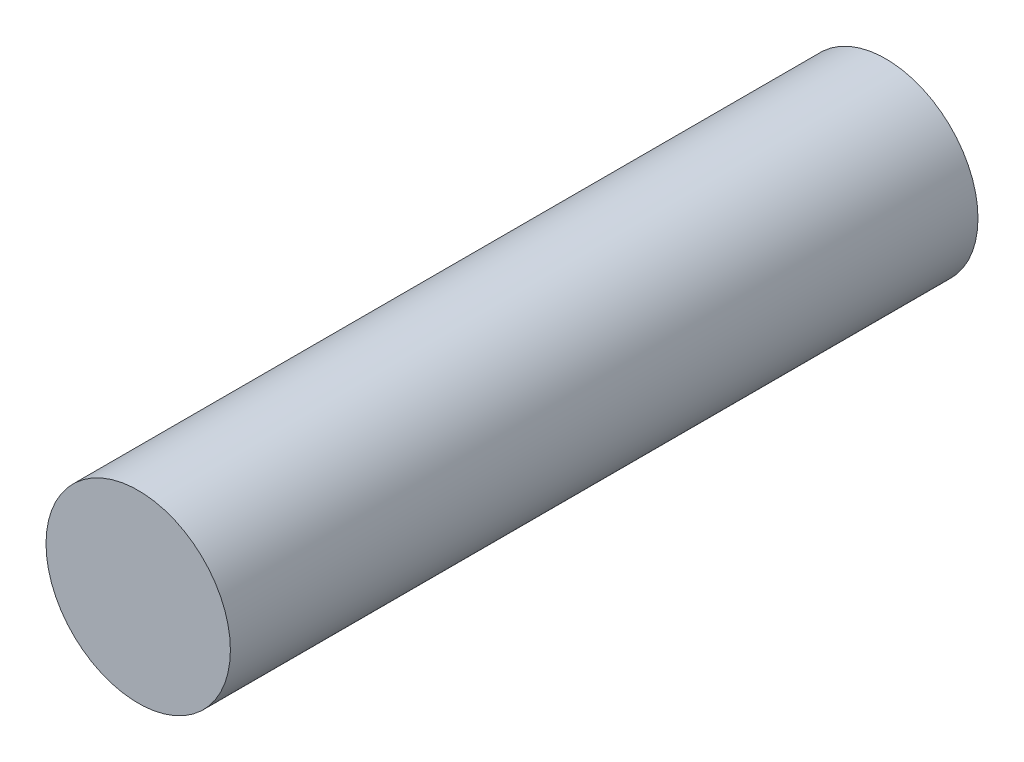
from build123d import *

# Parameters (mm, degrees)
SKETCH1_R          = 4.699
BASE_EXTRUDE_DEPTH = 38.1


with BuildPart() as part:
    # Sketch1 → Base-Extrude (new body)
    with BuildSketch(Plane.XY):
        with Locations(Location((0, 0, 0), (0, 0, 180))):
            Circle(SKETCH1_R)
    extrude(amount=BASE_EXTRUDE_DEPTH)


solid = part.part
